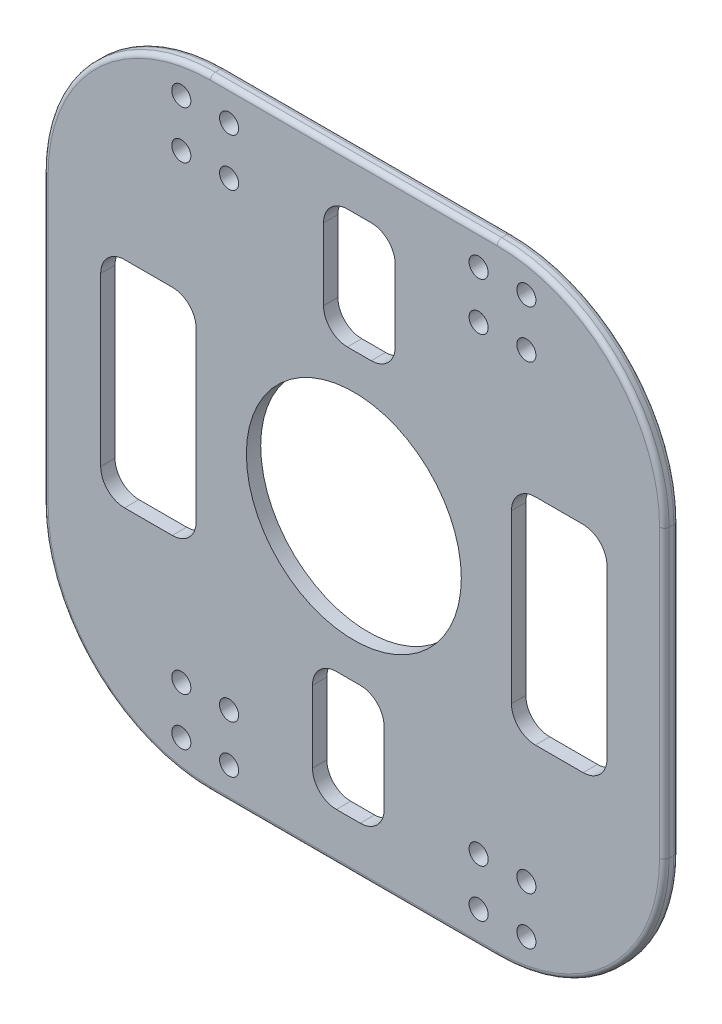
from build123d import *

# Parameters (mm, degrees)
SKETCH_1_W          = 130
SKETCH_1_H          = 130
SKETCH_1_R          = 22.5
EXTRUDE_1_DEPTH     = 3
FILLET_1_R          = 35
SKETCH_5_R          = 2
SKETCH_5_W          = 15
SKETCH_5_H          = 25
SKETCH_5_W_2        = 20
SKETCH_5_H_2        = 45
CUT_EXTRUDE_2_DEPTH = 13
FILLET_2_R          = 5
FILLET_3_R          = 1


with BuildPart() as part:
    # Sketch 1 → Extrude 1 (new body)
    with BuildSketch(Plane.XY):
        Rectangle(SKETCH_1_W, SKETCH_1_H)
        Circle(SKETCH_1_R, mode=Mode.SUBTRACT)
    extrude(amount=-EXTRUDE_1_DEPTH)

    # Fillet 1
    fillet_1_edges = [part.edges().sort_by_distance(p)[0] for p in [
        (65, -65, -1.5),
        (-65, -65, -1.5),
        (-65, 65, -1.5),
        (65, 65, -1.5),
    ]]
    fillet(fillet_1_edges, radius=FILLET_1_R)

    # Sketch 5 → Cut-Extrude 2 (cut)
    with BuildSketch(Plane(origin=(0, 0, -3), x_dir=(-1, 0, 0), z_dir=(0, 0, -1))):
        with Locations((36.119111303, 58.196758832)):
            Circle(SKETCH_5_R)
        with Locations((36.119111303, 48.196758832)):
            Circle(SKETCH_5_R)
        with Locations((-36.119111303, -58.196758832)):
            Circle(SKETCH_5_R)
        with Locations((26.119111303, 58.196758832)):
            Circle(SKETCH_5_R)
        with Locations((26.119111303, 48.196758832)):
            Circle(SKETCH_5_R)
        with Locations((26.119111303, -58.196758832)):
            Circle(SKETCH_5_R)
        with Locations((36.119111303, -48.196758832)):
            Circle(SKETCH_5_R)
        with Locations((36.119111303, -58.196758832)):
            Circle(SKETCH_5_R)
        with Locations((-36.119111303, -48.196758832)):
            Circle(SKETCH_5_R)
        with Locations((-26.119111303, -58.196758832)):
            Circle(SKETCH_5_R)
        with Locations((26.119111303, -48.196758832)):
            Circle(SKETCH_5_R)
        with Locations((-26.119111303, -48.196758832)):
            Circle(SKETCH_5_R)
        with Locations((-36.119111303, 48.196758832)):
            Circle(SKETCH_5_R)
        with Locations((-36.119111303, 58.196758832)):
            Circle(SKETCH_5_R)
        with Locations((-26.119111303, 58.196758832)):
            Circle(SKETCH_5_R)
        with Locations((-26.119111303, 48.196758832)):
            Circle(SKETCH_5_R)
        with Locations((-1.155156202, 42.5)):
            Rectangle(SKETCH_5_W, SKETCH_5_H)
        with Locations((-43, 0)):
            Rectangle(SKETCH_5_W_2, SKETCH_5_H_2)
        with Locations((1.155156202, -42.5)):
            Rectangle(SKETCH_5_W, SKETCH_5_H)
        with Locations((43, 0)):
            Rectangle(SKETCH_5_W_2, SKETCH_5_H_2)
    extrude(amount=-CUT_EXTRUDE_2_DEPTH, mode=Mode.SUBTRACT)

    # Fillet 2
    fillet_2_edges = [part.edges().sort_by_distance(p)[0] for p in [
        (6.344843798, -30, -1.5),
        (-8.655156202, -30, -1.5),
        (-8.655156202, -55, -1.5),
        (6.344843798, -55, -1.5),
        (53, -22.5, -1.5),
        (53, 22.5, -1.5),
        (33, 22.5, -1.5),
        (33, -22.5, -1.5),
        (-6.344843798, 30, -1.5),
        (8.655156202, 30, -1.5),
        (8.655156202, 55, -1.5),
        (-6.344843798, 55, -1.5),
        (-33, 22.5, -1.5),
        (-53, 22.5, -1.5),
        (-53, -22.5, -1.5),
        (-33, -22.5, -1.5),
    ]]
    fillet(fillet_2_edges, radius=FILLET_2_R)

    # Fillet 3
    fillet_3_edges = [part.edges().sort_by_distance(p)[0] for p in [
        (65, 0, 0),
        (65, 0, -3),
        (0, 65, 0),
        (-65, 0, 0),
        (0, -65, 0),
        (-54.748737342, -54.748737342, 0),
        (54.748737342, -54.748737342, 0),
        (-54.748737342, 54.748737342, 0),
        (54.748737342, 54.748737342, 0),
        (0, 65, -3),
        (0, -65, -3),
        (-65, 0, -3),
        (-54.748737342, -54.748737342, -3),
        (54.748737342, -54.748737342, -3),
        (-54.748737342, 54.748737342, -3),
        (54.748737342, 54.748737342, -3),
    ]]
    fillet(fillet_3_edges, radius=FILLET_3_R)


solid = part.part
